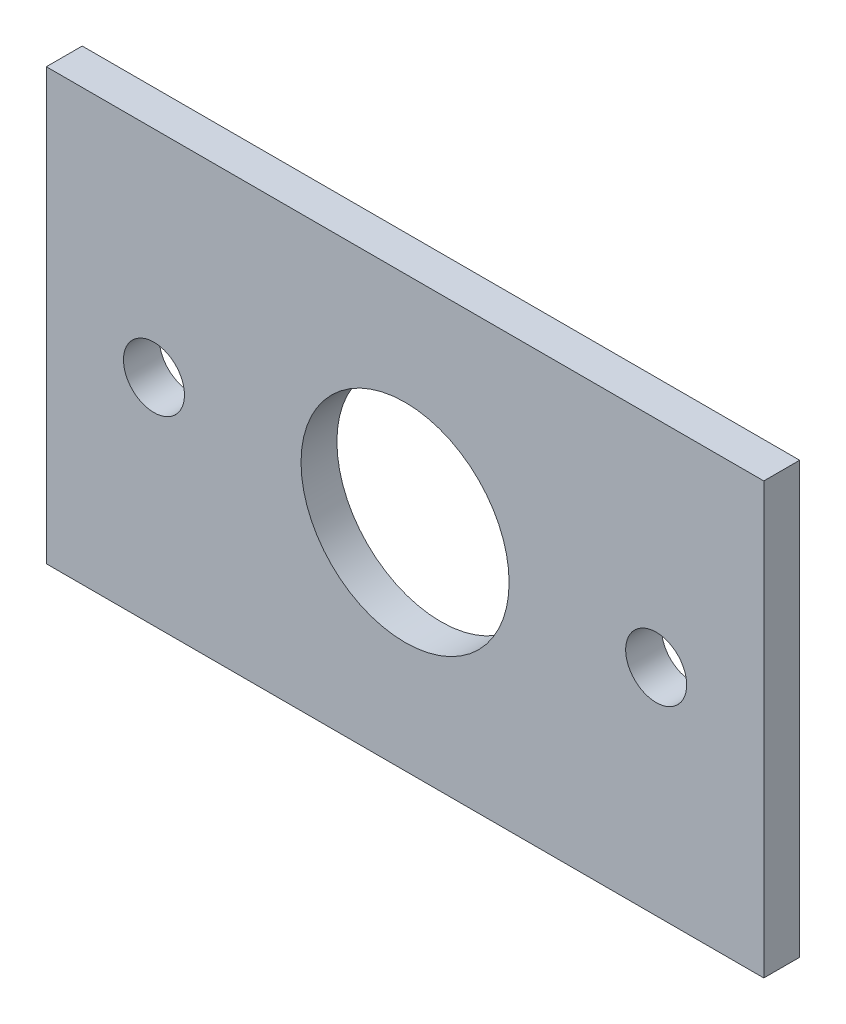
from build123d import *

# Parameters (mm, degrees)
SKETCH_1_W                     = 40
SKETCH_1_H                     = 24
SKETCH_1_R                     = 5.8
SKETCH_1_R_2                   = 1.7
BEARING_RETAINER_40X24X2_DEPTH = 2


with BuildPart() as part:
    # Sketch 1 → Bearing_retainer_40x24x2 (new body)
    with BuildSketch(Plane.XY):
        Rectangle(SKETCH_1_W, SKETCH_1_H)
        Circle(SKETCH_1_R, mode=Mode.SUBTRACT)
        with Locations((-14, 0)):
            Circle(SKETCH_1_R_2, mode=Mode.SUBTRACT)
        with Locations((14, 0)):
            Circle(SKETCH_1_R_2, mode=Mode.SUBTRACT)
    extrude(amount=BEARING_RETAINER_40X24X2_DEPTH)


solid = part.part
